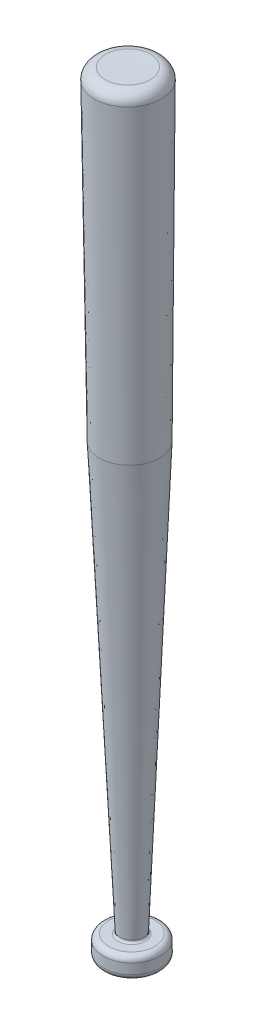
ISO-10303-21;
HEADER;
FILE_DESCRIPTION(('STEP AP214'),'2;1');
FILE_NAME('part.step','',(''),(''),'','','');
FILE_SCHEMA(('AUTOMOTIVE_DESIGN { 1 0 10303 214 1 1 1 1 }'));
ENDSEC;
DATA;
#1=APPLICATION_CONTEXT('core data for automotive mechanical design processes');
#2=APPLICATION_PROTOCOL_DEFINITION('international standard','automotive_design',2000,#1);
#3=PRODUCT_CONTEXT('',#1,'mechanical');
#4=PRODUCT('Part','Part','',(#3));
#5=PRODUCT_RELATED_PRODUCT_CATEGORY('part','',(#4));
#6=PRODUCT_DEFINITION_FORMATION('','',#4);
#7=PRODUCT_DEFINITION_CONTEXT('part definition',#1,'design');
#8=PRODUCT_DEFINITION('design','',#6,#7);
#9=PRODUCT_DEFINITION_SHAPE('','',#8);
#10=(LENGTH_UNIT() NAMED_UNIT(*) SI_UNIT(.MILLI.,.METRE.));
#11=(NAMED_UNIT(*) PLANE_ANGLE_UNIT() SI_UNIT($,.RADIAN.));
#12=(NAMED_UNIT(*) SI_UNIT($,.STERADIAN.) SOLID_ANGLE_UNIT());
#13=UNCERTAINTY_MEASURE_WITH_UNIT(LENGTH_MEASURE(1.E-05),#10,'distance_accuracy_value','');
#14=(GEOMETRIC_REPRESENTATION_CONTEXT(3) GLOBAL_UNCERTAINTY_ASSIGNED_CONTEXT((#13)) GLOBAL_UNIT_ASSIGNED_CONTEXT((#10,
#11,#12)) REPRESENTATION_CONTEXT('',''));
#15=CARTESIAN_POINT('',(0.,0.,0.));
#16=DIRECTION('',(0.,0.,1.));
#17=DIRECTION('',(1.,0.,0.));
#18=AXIS2_PLACEMENT_3D('',#15,#16,#17);
#19=CARTESIAN_POINT('',(-0.000291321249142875,0.0552362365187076,0.));
#20=DIRECTION('',(-0.00527402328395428,0.999986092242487,0.));
#21=DIRECTION('',(-0.999986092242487,-0.00527402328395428,0.));
#22=AXIS2_PLACEMENT_3D('',#19,#20,#21);
#23=CONICAL_SURFACE('',#22,10.4732636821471,1.56552227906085);
#24=CARTESIAN_POINT('',(0.,0.,0.));
#25=VERTEX_POINT('',#24);
#26=VERTEX_LOOP('',#25);
#27=FACE_BOUND('',#26,.T.);
#28=CARTESIAN_POINT('',(-0.000291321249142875,0.0552362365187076,0.));
#29=DIRECTION('',(-0.00527402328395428,0.999986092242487,0.));
#30=DIRECTION('',(-0.999986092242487,-0.00527402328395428,0.));
#31=AXIS2_PLACEMENT_3D('',#28,#29,#30);
#32=CIRCLE('',#31,10.4732636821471);
#33=CARTESIAN_POINT('',(-10.4734093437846,0.,0.));
#34=VERTEX_POINT('',#33);
#35=EDGE_CURVE('E11',#34,#34,#32,.T.);
#36=ORIENTED_EDGE('',*,*,#35,.F.);
#37=EDGE_LOOP('',(#36));
#38=FACE_BOUND('',#37,.T.);
#39=ADVANCED_FACE('F26',(#27,#38),#23,.T.);
#40=CARTESIAN_POINT('',(-0.0136871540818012,2.5951655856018,0.));
#41=DIRECTION('',(-0.00527402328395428,0.999986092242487,0.));
#42=DIRECTION('',(-0.999986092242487,-0.00527402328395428,0.));
#43=AXIS2_PLACEMENT_3D('',#40,#41,#42);
#44=TOROIDAL_SURFACE('',#43,10.4598676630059,2.54);
#45=ORIENTED_EDGE('',*,*,#35,.T.);
#46=EDGE_LOOP('',(#45));
#47=FACE_BOUND('',#46,.T.);
#48=CARTESIAN_POINT('',(-0.0137578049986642,2.60856141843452,0.));
#49=DIRECTION('',(-0.00527402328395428,0.999986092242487,0.));
#50=DIRECTION('',(-0.999986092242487,-0.00527402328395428,0.));
#51=AXIS2_PLACEMENT_3D('',#48,#49,#50);
#52=CIRCLE('',#51,12.9998323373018);
#53=CARTESIAN_POINT('',(12.9858937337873,2.67712283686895,0.));
#54=VERTEX_POINT('',#53);
#55=EDGE_CURVE('E33',#54,#54,#52,.T.);
#56=ORIENTED_EDGE('',*,*,#55,.F.);
#57=EDGE_LOOP('',(#56));
#58=FACE_BOUND('',#57,.T.);
#59=ADVANCED_FACE('F52',(#47,#58),#44,.T.);
#60=CARTESIAN_POINT('',(-0.0377629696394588,7.1600829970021,0.));
#61=DIRECTION('',(0.00527402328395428,-0.999986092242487,0.));
#62=DIRECTION('',(0.999986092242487,0.00527402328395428,0.));
#63=AXIS2_PLACEMENT_3D('',#60,#61,#62);
#64=CONICAL_SURFACE('',#63,12.9758268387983,0.00527404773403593);
#65=CARTESIAN_POINT('',(-0.0377629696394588,7.1600829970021,0.));
#66=DIRECTION('',(-0.00527402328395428,0.999986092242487,0.));
#67=DIRECTION('',(-0.999986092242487,-0.00527402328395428,0.));
#68=AXIS2_PLACEMENT_3D('',#65,#66,#67);
#69=CIRCLE('',#68,12.9758268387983);
#70=CARTESIAN_POINT('',(12.9378834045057,7.22851780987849,0.));
#71=VERTEX_POINT('',#70);
#72=EDGE_CURVE('E64',#71,#71,#69,.T.);
#73=CARTESIAN_POINT('',(12.9858937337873,2.67712283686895,0.));
#74=CARTESIAN_POINT('',(12.9853936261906,2.72453320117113,0.));
#75=CARTESIAN_POINT('',(12.9848935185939,2.77194356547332,0.));
#76=CARTESIAN_POINT('',(12.9838933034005,2.86676429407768,0.));
#77=CARTESIAN_POINT('',(12.9833931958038,2.91417465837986,0.));
#78=CARTESIAN_POINT('',(12.9823929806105,3.00899538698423,0.));
#79=CARTESIAN_POINT('',(12.9818928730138,3.05640575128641,0.));
#80=CARTESIAN_POINT('',(12.9808926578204,3.15122647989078,0.));
#81=CARTESIAN_POINT('',(12.9803925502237,3.19863684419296,0.));
#82=CARTESIAN_POINT('',(12.9793923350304,3.29345757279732,0.));
#83=CARTESIAN_POINT('',(12.9788922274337,3.34086793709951,0.));
#84=CARTESIAN_POINT('',(12.9778920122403,3.43568866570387,0.));
#85=CARTESIAN_POINT('',(12.9773919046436,3.48309903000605,0.));
#86=CARTESIAN_POINT('',(12.9763916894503,3.57791975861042,0.));
#87=CARTESIAN_POINT('',(12.9758915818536,3.6253301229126,0.));
#88=CARTESIAN_POINT('',(12.9748913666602,3.72015085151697,0.));
#89=CARTESIAN_POINT('',(12.9743912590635,3.76756121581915,0.));
#90=CARTESIAN_POINT('',(12.9733910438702,3.86238194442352,0.));
#91=CARTESIAN_POINT('',(12.9728909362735,3.9097923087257,0.));
#92=CARTESIAN_POINT('',(12.9718907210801,4.00461303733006,0.));
#93=CARTESIAN_POINT('',(12.9713906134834,4.05202340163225,0.));
#94=CARTESIAN_POINT('',(12.9703903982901,4.14684413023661,0.));
#95=CARTESIAN_POINT('',(12.9698902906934,4.19425449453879,0.));
#96=CARTESIAN_POINT('',(12.9688900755,4.28907522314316,0.));
#97=CARTESIAN_POINT('',(12.9683899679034,4.33648558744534,0.));
#98=CARTESIAN_POINT('',(12.96738975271,4.43130631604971,0.));
#99=CARTESIAN_POINT('',(12.9668896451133,4.47871668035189,0.));
#100=CARTESIAN_POINT('',(12.9658894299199,4.57353740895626,0.));
#101=CARTESIAN_POINT('',(12.9653893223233,4.62094777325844,0.));
#102=CARTESIAN_POINT('',(12.9643891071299,4.7157685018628,0.));
#103=CARTESIAN_POINT('',(12.9638889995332,4.76317886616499,0.));
#104=CARTESIAN_POINT('',(12.9628887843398,4.85799959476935,0.));
#105=CARTESIAN_POINT('',(12.9623886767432,4.90540995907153,0.));
#106=CARTESIAN_POINT('',(12.9613884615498,5.0002306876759,0.));
#107=CARTESIAN_POINT('',(12.9608883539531,5.04764105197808,0.));
#108=CARTESIAN_POINT('',(12.9598881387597,5.14246178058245,0.));
#109=CARTESIAN_POINT('',(12.9593880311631,5.18987214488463,0.));
#110=CARTESIAN_POINT('',(12.9583878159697,5.284692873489,0.));
#111=CARTESIAN_POINT('',(12.957887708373,5.33210323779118,0.));
#112=CARTESIAN_POINT('',(12.9568874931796,5.42692396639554,0.));
#113=CARTESIAN_POINT('',(12.956387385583,5.47433433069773,0.));
#114=CARTESIAN_POINT('',(12.9553871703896,5.56915505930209,0.));
#115=CARTESIAN_POINT('',(12.9548870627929,5.61656542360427,0.));
#116=CARTESIAN_POINT('',(12.9538868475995,5.71138615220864,0.));
#117=CARTESIAN_POINT('',(12.9533867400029,5.75879651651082,0.));
#118=CARTESIAN_POINT('',(12.9523865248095,5.85361724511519,0.));
#119=CARTESIAN_POINT('',(12.9518864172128,5.90102760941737,0.));
#120=CARTESIAN_POINT('',(12.9508862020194,5.99584833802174,0.));
#121=CARTESIAN_POINT('',(12.9503860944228,6.04325870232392,0.));
#122=CARTESIAN_POINT('',(12.9493858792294,6.13807943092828,0.));
#123=CARTESIAN_POINT('',(12.9488857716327,6.18548979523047,0.));
#124=CARTESIAN_POINT('',(12.9478855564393,6.28031052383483,0.));
#125=CARTESIAN_POINT('',(12.9473854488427,6.32772088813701,0.));
#126=CARTESIAN_POINT('',(12.9463852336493,6.42254161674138,0.));
#127=CARTESIAN_POINT('',(12.9458851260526,6.46995198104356,0.));
#128=CARTESIAN_POINT('',(12.9448849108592,6.56477270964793,0.));
#129=CARTESIAN_POINT('',(12.9443848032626,6.61218307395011,0.));
#130=CARTESIAN_POINT('',(12.9433845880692,6.70700380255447,0.));
#131=CARTESIAN_POINT('',(12.9428844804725,6.75441416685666,0.));
#132=CARTESIAN_POINT('',(12.9418842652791,6.84923489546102,0.));
#133=CARTESIAN_POINT('',(12.9413841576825,6.89664525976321,0.));
#134=CARTESIAN_POINT('',(12.9403839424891,6.99146598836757,0.));
#135=CARTESIAN_POINT('',(12.9398838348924,7.03887635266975,0.));
#136=CARTESIAN_POINT('',(12.938883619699,7.13369708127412,0.));
#137=CARTESIAN_POINT('',(12.9383835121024,7.1811074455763,0.));
#138=CARTESIAN_POINT('',(12.9378834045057,7.22851780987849,0.));
#139=B_SPLINE_CURVE_WITH_KNOTS('',3,(#73,#74,#75,#76,#77,#78,#79,#80,#81,#82,#83,#84,#85,#86,
#87,#88,#89,#90,#91,#92,#93,#94,#95,#96,#97,#98,#99,#100,#101,#102,#103,#104,#105,#106,#107,
#108,#109,#110,#111,#112,#113,#114,#115,#116,#117,#118,#119,#120,#121,#122,#123,#124,#125,#126,
#127,#128,#129,#130,#131,#132,#133,#134,#135,#136,#137,#138),.UNSPECIFIED.,.F.,.F.,(4,2,2,2,2,2,
2,2,2,2,2,2,2,2,2,2,2,2,2,2,2,2,2,2,2,2,2,2,2,2,2,2,4),(0.,0.142239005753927,0.284478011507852,
0.426717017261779,0.568956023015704,0.711195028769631,0.853434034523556,0.995673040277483,
1.13791204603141,1.28015105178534,1.42239005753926,1.56462906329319,1.70686806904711,
1.84910707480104,1.99134608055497,2.13358508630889,2.27582409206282,2.41806309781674,
2.56030210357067,2.7025411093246,2.84478011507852,2.98701912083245,3.12925812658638,
3.2714971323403,3.41373613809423,3.55597514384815,3.69821414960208,3.84045315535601,
3.98269216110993,4.12493116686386,4.26717017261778,4.40940917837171,4.55164818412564),.UNSPECIFIED.);
#140=EDGE_CURVE('BSEAM56',#54,#71,#139,.T.);
#141=ORIENTED_EDGE('',*,*,#55,.T.);
#142=ORIENTED_EDGE('',*,*,#72,.F.);
#143=ORIENTED_EDGE('',*,*,#140,.T.);
#144=ORIENTED_EDGE('',*,*,#140,.F.);
#145=EDGE_LOOP('',(#141,#143,#142,#144));
#146=FACE_BOUND('',#145,.T.);
#147=ADVANCED_FACE('F56',(#146),#64,.T.);
#148=CARTESIAN_POINT('',(-0.0376923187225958,7.14668716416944,0.));
#149=DIRECTION('',(-0.00527402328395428,0.999986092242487,0.));
#150=DIRECTION('',(-0.999986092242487,-0.00527402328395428,0.));
#151=AXIS2_PLACEMENT_3D('',#148,#149,#150);
#152=TOROIDAL_SURFACE('',#151,10.4358621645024,2.54);
#153=ORIENTED_EDGE('',*,*,#72,.T.);
#154=EDGE_LOOP('',(#153));
#155=FACE_BOUND('',#154,.T.);
#156=CARTESIAN_POINT('',(-0.0510881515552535,9.68661651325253,0.));
#157=DIRECTION('',(-0.00527402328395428,0.999986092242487,0.));
#158=DIRECTION('',(-0.999986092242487,-0.00527402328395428,0.));
#159=AXIS2_PLACEMENT_3D('',#156,#157,#158);
#160=CIRCLE('',#159,10.4224661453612);
#161=CARTESIAN_POINT('',(-10.4734093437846,9.63164818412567,0.));
#162=VERTEX_POINT('',#161);
#163=EDGE_CURVE('E66',#162,#162,#160,.T.);
#164=ORIENTED_EDGE('',*,*,#163,.F.);
#165=EDGE_LOOP('',(#164));
#166=FACE_BOUND('',#165,.T.);
#167=ADVANCED_FACE('F105',(#155,#166),#152,.T.);
#168=CARTESIAN_POINT('',(-0.0509715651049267,9.66451103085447,0.));
#169=DIRECTION('',(-0.00527402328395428,0.999986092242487,0.));
#170=DIRECTION('',(-0.999986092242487,-0.00527402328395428,0.));
#171=AXIS2_PLACEMENT_3D('',#168,#169,#170);
#172=CONICAL_SURFACE('',#171,6.23107729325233,1.56552227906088);
#173=CARTESIAN_POINT('',(-0.0509715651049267,9.66451103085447,0.));
#174=DIRECTION('',(-0.00527402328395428,0.999986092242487,0.));
#175=DIRECTION('',(-0.999986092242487,-0.00527402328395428,0.));
#176=AXIS2_PLACEMENT_3D('',#173,#174,#175);
#177=CIRCLE('',#176,6.23107729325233);
#178=CARTESIAN_POINT('',(-6.28196219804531,9.63164818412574,0.));
#179=VERTEX_POINT('',#178);
#180=EDGE_CURVE('E71',#179,#179,#177,.T.);
#181=CARTESIAN_POINT('',(-10.4734093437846,9.63164818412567,0.));
#182=CARTESIAN_POINT('',(-10.4297484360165,9.63164818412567,0.));
#183=CARTESIAN_POINT('',(-10.3860875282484,9.63164818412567,0.));
#184=CARTESIAN_POINT('',(-10.2987657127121,9.63164818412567,0.));
#185=CARTESIAN_POINT('',(-10.255104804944,9.63164818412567,0.));
#186=CARTESIAN_POINT('',(-10.1677829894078,9.63164818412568,0.));
#187=CARTESIAN_POINT('',(-10.1241220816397,9.63164818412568,0.));
#188=CARTESIAN_POINT('',(-10.0368002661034,9.63164818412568,0.));
#189=CARTESIAN_POINT('',(-9.99313935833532,9.63164818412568,0.));
#190=CARTESIAN_POINT('',(-9.90581754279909,9.63164818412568,0.));
#191=CARTESIAN_POINT('',(-9.86215663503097,9.63164818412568,0.));
#192=CARTESIAN_POINT('',(-9.77483481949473,9.63164818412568,0.));
#193=CARTESIAN_POINT('',(-9.73117391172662,9.63164818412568,0.));
#194=CARTESIAN_POINT('',(-9.64385209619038,9.63164818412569,0.));
#195=CARTESIAN_POINT('',(-9.60019118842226,9.63164818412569,0.));
#196=CARTESIAN_POINT('',(-9.51286937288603,9.63164818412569,0.));
#197=CARTESIAN_POINT('',(-9.46920846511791,9.63164818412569,0.));
#198=CARTESIAN_POINT('',(-9.38188664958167,9.63164818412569,0.));
#199=CARTESIAN_POINT('',(-9.33822574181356,9.63164818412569,0.));
#200=CARTESIAN_POINT('',(-9.25090392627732,9.63164818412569,0.));
#201=CARTESIAN_POINT('',(-9.2072430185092,9.63164818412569,0.));
#202=CARTESIAN_POINT('',(-9.11992120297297,9.63164818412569,0.));
#203=CARTESIAN_POINT('',(-9.07626029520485,9.63164818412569,0.));
#204=CARTESIAN_POINT('',(-8.98893847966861,9.6316481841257,0.));
#205=CARTESIAN_POINT('',(-8.9452775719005,9.6316481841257,0.));
#206=CARTESIAN_POINT('',(-8.85795575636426,9.6316481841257,0.));
#207=CARTESIAN_POINT('',(-8.81429484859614,9.6316481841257,0.));
#208=CARTESIAN_POINT('',(-8.72697303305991,9.6316481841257,0.));
#209=CARTESIAN_POINT('',(-8.68331212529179,9.6316481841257,0.));
#210=CARTESIAN_POINT('',(-8.59599030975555,9.6316481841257,0.));
#211=CARTESIAN_POINT('',(-8.55232940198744,9.6316481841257,0.));
#212=CARTESIAN_POINT('',(-8.4650075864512,9.63164818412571,0.));
#213=CARTESIAN_POINT('',(-8.42134667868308,9.63164818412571,0.));
#214=CARTESIAN_POINT('',(-8.33402486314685,9.63164818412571,0.));
#215=CARTESIAN_POINT('',(-8.29036395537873,9.63164818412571,0.));
#216=CARTESIAN_POINT('',(-8.20304213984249,9.63164818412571,0.));
#217=CARTESIAN_POINT('',(-8.15938123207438,9.63164818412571,0.));
#218=CARTESIAN_POINT('',(-8.07205941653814,9.63164818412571,0.));
#219=CARTESIAN_POINT('',(-8.02839850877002,9.63164818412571,0.));
#220=CARTESIAN_POINT('',(-7.94107669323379,9.63164818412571,0.));
#221=CARTESIAN_POINT('',(-7.89741578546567,9.63164818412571,0.));
#222=CARTESIAN_POINT('',(-7.81009396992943,9.63164818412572,0.));
#223=CARTESIAN_POINT('',(-7.76643306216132,9.63164818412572,0.));
#224=CARTESIAN_POINT('',(-7.67911124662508,9.63164818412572,0.));
#225=CARTESIAN_POINT('',(-7.63545033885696,9.63164818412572,0.));
#226=CARTESIAN_POINT('',(-7.54812852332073,9.63164818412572,0.));
#227=CARTESIAN_POINT('',(-7.50446761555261,9.63164818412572,0.));
#228=CARTESIAN_POINT('',(-7.41714580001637,9.63164818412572,0.));
#229=CARTESIAN_POINT('',(-7.37348489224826,9.63164818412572,0.));
#230=CARTESIAN_POINT('',(-7.28616307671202,9.63164818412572,0.));
#231=CARTESIAN_POINT('',(-7.2425021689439,9.63164818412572,0.));
#232=CARTESIAN_POINT('',(-7.15518035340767,9.63164818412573,0.));
#233=CARTESIAN_POINT('',(-7.11151944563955,9.63164818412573,0.));
#234=CARTESIAN_POINT('',(-7.02419763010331,9.63164818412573,0.));
#235=CARTESIAN_POINT('',(-6.9805367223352,9.63164818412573,0.));
#236=CARTESIAN_POINT('',(-6.89321490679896,9.63164818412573,0.));
#237=CARTESIAN_POINT('',(-6.84955399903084,9.63164818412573,0.));
#238=CARTESIAN_POINT('',(-6.76223218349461,9.63164818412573,0.));
#239=CARTESIAN_POINT('',(-6.71857127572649,9.63164818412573,0.));
#240=CARTESIAN_POINT('',(-6.63124946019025,9.63164818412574,0.));
#241=CARTESIAN_POINT('',(-6.58758855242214,9.63164818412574,0.));
#242=CARTESIAN_POINT('',(-6.5002667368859,9.63164818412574,0.));
#243=CARTESIAN_POINT('',(-6.45660582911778,9.63164818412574,0.));
#244=CARTESIAN_POINT('',(-6.36928401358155,9.63164818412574,0.));
#245=CARTESIAN_POINT('',(-6.32562310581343,9.63164818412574,0.));
#246=CARTESIAN_POINT('',(-6.28196219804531,9.63164818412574,0.));
#247=B_SPLINE_CURVE_WITH_KNOTS('',3,(#181,#182,#183,#184,#185,#186,#187,#188,#189,#190,#191,
#192,#193,#194,#195,#196,#197,#198,#199,#200,#201,#202,#203,#204,#205,#206,#207,#208,#209,#210,
#211,#212,#213,#214,#215,#216,#217,#218,#219,#220,#221,#222,#223,#224,#225,#226,#227,#228,#229,
#230,#231,#232,#233,#234,#235,#236,#237,#238,#239,#240,#241,#242,#243,#244,#245,#246),
.UNSPECIFIED.,.F.,.F.,(4,2,2,2,2,2,2,2,2,2,2,2,2,2,2,2,2,2,2,2,2,2,2,2,2,2,2,2,2,2,2,2,4),(0.,
0.130982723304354,0.261965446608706,0.39294816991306,0.523930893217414,0.654913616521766,
0.785896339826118,0.916879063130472,1.04786178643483,1.17884450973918,1.30982723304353,
1.44080995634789,1.57179267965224,1.70277540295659,1.83375812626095,1.9647408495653,
2.09572357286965,2.22670629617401,2.35768901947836,2.48867174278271,2.61965446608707,
2.75063718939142,2.88161991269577,3.01260263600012,3.14358535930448,3.27456808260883,
3.40555080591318,3.53653352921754,3.66751625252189,3.79849897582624,3.9294816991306,
4.06046442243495,4.1914471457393),.UNSPECIFIED.);
#248=EDGE_CURVE('BSEAM101',#162,#179,#247,.T.);
#249=ORIENTED_EDGE('',*,*,#163,.T.);
#250=ORIENTED_EDGE('',*,*,#180,.F.);
#251=ORIENTED_EDGE('',*,*,#248,.T.);
#252=ORIENTED_EDGE('',*,*,#248,.F.);
#253=EDGE_LOOP('',(#249,#251,#250,#252));
#254=FACE_BOUND('',#253,.T.);
#255=ADVANCED_FACE('F101',(#254),#172,.F.);
#256=CARTESIAN_POINT('',(-0.0556664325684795,10.5546857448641,0.));
#257=DIRECTION('',(-0.00527402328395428,0.999986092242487,0.));
#258=DIRECTION('',(-0.999986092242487,-0.00527402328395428,0.));
#259=AXIS2_PLACEMENT_3D('',#256,#257,#258);
#260=TOROIDAL_SURFACE('',#259,6.22638236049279,0.890199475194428);
#261=ORIENTED_EDGE('',*,*,#180,.T.);
#262=EDGE_LOOP('',(#261));
#263=FACE_BOUND('',#262,.T.);
#264=CARTESIAN_POINT('',(-0.0569990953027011,10.8073665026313,0.));
#265=DIRECTION('',(-0.00527402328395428,0.999986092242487,0.));
#266=DIRECTION('',(-0.999986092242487,-0.00527402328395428,0.));
#267=AXIS2_PLACEMENT_3D('',#264,#265,#266);
#268=CIRCLE('',#267,5.37279829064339);
#269=CARTESIAN_POINT('',(-5.4297226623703,10.7790302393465,0.));
#270=VERTEX_POINT('',#269);
#271=EDGE_CURVE('E74',#270,#270,#268,.T.);
#272=ORIENTED_EDGE('',*,*,#271,.F.);
#273=EDGE_LOOP('',(#272));
#274=FACE_BOUND('',#273,.T.);
#275=ADVANCED_FACE('F95',(#263,#274),#260,.F.);
#276=CARTESIAN_POINT('',(-1.07220957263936,203.29729371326,0.));
#277=DIRECTION('',(-0.00527402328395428,0.999986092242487,0.));
#278=DIRECTION('',(-0.999986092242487,-0.00527402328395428,0.));
#279=AXIS2_PLACEMENT_3D('',#276,#277,#278);
#280=CONICAL_SURFACE('',#279,13.6837631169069,0.0431487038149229);
#281=CARTESIAN_POINT('',(-1.07220957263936,203.29729371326,0.));
#282=DIRECTION('',(-0.00527402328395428,0.999986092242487,0.));
#283=DIRECTION('',(-0.999986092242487,-0.00527402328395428,0.));
#284=AXIS2_PLACEMENT_3D('',#281,#282,#283);
#285=CIRCLE('',#284,13.6837631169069);
#286=CARTESIAN_POINT('',(-14.7557823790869,203.225125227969,0.));
#287=VERTEX_POINT('',#286);
#288=EDGE_CURVE('E77',#287,#287,#285,.T.);
#289=CARTESIAN_POINT('',(-5.4297226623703,10.7790302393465,0.));
#290=CARTESIAN_POINT('',(-5.52686911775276,12.7836770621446,0.));
#291=CARTESIAN_POINT('',(-5.62401557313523,14.7883238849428,0.));
#292=CARTESIAN_POINT('',(-5.81830848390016,18.7976175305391,0.));
#293=CARTESIAN_POINT('',(-5.91545493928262,20.8022643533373,0.));
#294=CARTESIAN_POINT('',(-6.10974785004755,24.8115579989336,0.));
#295=CARTESIAN_POINT('',(-6.20689430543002,26.8162048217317,0.));
#296=CARTESIAN_POINT('',(-6.40118721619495,30.825498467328,0.));
#297=CARTESIAN_POINT('',(-6.49833367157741,32.8301452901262,0.));
#298=CARTESIAN_POINT('',(-6.69262658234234,36.8394389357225,0.));
#299=CARTESIAN_POINT('',(-6.78977303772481,38.8440857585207,0.));
#300=CARTESIAN_POINT('',(-6.98406594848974,42.853379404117,0.));
#301=CARTESIAN_POINT('',(-7.0812124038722,44.8580262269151,0.));
#302=CARTESIAN_POINT('',(-7.27550531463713,48.8673198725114,0.));
#303=CARTESIAN_POINT('',(-7.3726517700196,50.8719666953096,0.));
#304=CARTESIAN_POINT('',(-7.56694468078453,54.8812603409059,0.));
#305=CARTESIAN_POINT('',(-7.66409113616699,56.885907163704,0.));
#306=CARTESIAN_POINT('',(-7.85838404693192,60.8952008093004,0.));
#307=CARTESIAN_POINT('',(-7.95553050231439,62.8998476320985,0.));
#308=CARTESIAN_POINT('',(-8.14982341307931,66.9091412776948,0.));
#309=CARTESIAN_POINT('',(-8.24696986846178,68.913788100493,0.));
#310=CARTESIAN_POINT('',(-8.44126277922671,72.9230817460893,0.));
#311=CARTESIAN_POINT('',(-8.53840923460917,74.9277285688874,0.));
#312=CARTESIAN_POINT('',(-8.7327021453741,78.9370222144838,0.));
#313=CARTESIAN_POINT('',(-8.82984860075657,80.9416690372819,0.));
#314=CARTESIAN_POINT('',(-9.0241415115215,84.9509626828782,0.));
#315=CARTESIAN_POINT('',(-9.12128796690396,86.9556095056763,0.));
#316=CARTESIAN_POINT('',(-9.31558087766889,90.9649031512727,0.));
#317=CARTESIAN_POINT('',(-9.41272733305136,92.9695499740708,0.));
#318=CARTESIAN_POINT('',(-9.60702024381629,96.9788436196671,0.));
#319=CARTESIAN_POINT('',(-9.70416669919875,98.9834904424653,0.));
#320=CARTESIAN_POINT('',(-9.89845960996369,102.992784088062,0.));
#321=CARTESIAN_POINT('',(-9.99560606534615,104.99743091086,0.));
#322=CARTESIAN_POINT('',(-10.1898989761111,109.006724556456,0.));
#323=CARTESIAN_POINT('',(-10.2870454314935,111.011371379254,0.));
#324=CARTESIAN_POINT('',(-10.4813383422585,115.020665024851,0.));
#325=CARTESIAN_POINT('',(-10.5784847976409,117.025311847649,0.));
#326=CARTESIAN_POINT('',(-10.7727777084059,121.034605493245,0.));
#327=CARTESIAN_POINT('',(-10.8699241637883,123.039252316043,0.));
#328=CARTESIAN_POINT('',(-11.0642170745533,127.048545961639,0.));
#329=CARTESIAN_POINT('',(-11.1613635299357,129.053192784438,0.));
#330=CARTESIAN_POINT('',(-11.3556564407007,133.062486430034,0.));
#331=CARTESIAN_POINT('',(-11.4528028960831,135.067133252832,0.));
#332=CARTESIAN_POINT('',(-11.6470958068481,139.076426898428,0.));
#333=CARTESIAN_POINT('',(-11.7442422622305,141.081073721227,0.));
#334=CARTESIAN_POINT('',(-11.9385351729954,145.090367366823,0.));
#335=CARTESIAN_POINT('',(-12.0356816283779,147.095014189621,0.));
#336=CARTESIAN_POINT('',(-12.2299745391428,151.104307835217,0.));
#337=CARTESIAN_POINT('',(-12.3271209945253,153.108954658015,0.));
#338=CARTESIAN_POINT('',(-12.5214139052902,157.118248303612,0.));
#339=CARTESIAN_POINT('',(-12.6185603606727,159.12289512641,0.));
#340=CARTESIAN_POINT('',(-12.8128532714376,163.132188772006,0.));
#341=CARTESIAN_POINT('',(-12.9099997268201,165.136835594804,0.));
#342=CARTESIAN_POINT('',(-13.104292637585,169.146129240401,0.));
#343=CARTESIAN_POINT('',(-13.2014390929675,171.150776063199,0.));
#344=CARTESIAN_POINT('',(-13.3957320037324,175.160069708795,0.));
#345=CARTESIAN_POINT('',(-13.4928784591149,177.164716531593,0.));
#346=CARTESIAN_POINT('',(-13.6871713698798,181.17401017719,0.));
#347=CARTESIAN_POINT('',(-13.7843178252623,183.178656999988,0.));
#348=CARTESIAN_POINT('',(-13.9786107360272,187.187950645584,0.));
#349=CARTESIAN_POINT('',(-14.0757571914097,189.192597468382,0.));
#350=CARTESIAN_POINT('',(-14.2700501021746,193.201891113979,0.));
#351=CARTESIAN_POINT('',(-14.3671965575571,195.206537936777,0.));
#352=CARTESIAN_POINT('',(-14.561489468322,199.215831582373,0.));
#353=CARTESIAN_POINT('',(-14.6586359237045,201.220478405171,0.));
#354=CARTESIAN_POINT('',(-14.7557823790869,203.225125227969,0.));
#355=B_SPLINE_CURVE_WITH_KNOTS('',3,(#289,#290,#291,#292,#293,#294,#295,#296,#297,#298,#299,
#300,#301,#302,#303,#304,#305,#306,#307,#308,#309,#310,#311,#312,#313,#314,#315,#316,#317,#318,
#319,#320,#321,#322,#323,#324,#325,#326,#327,#328,#329,#330,#331,#332,#333,#334,#335,#336,#337,
#338,#339,#340,#341,#342,#343,#344,#345,#346,#347,#348,#349,#350,#351,#352,#353,#354),
.UNSPECIFIED.,.F.,.F.,(4,2,2,2,2,2,2,2,2,2,2,2,2,2,2,2,2,2,2,2,2,2,2,2,2,2,2,2,2,2,2,2,4),(0.,
6.0209979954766,12.0419959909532,18.0629939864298,24.0839919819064,30.1049899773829,
36.1259879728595,42.1469859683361,48.1679839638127,54.1889819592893,60.2099799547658,
66.2309779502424,72.251975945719,78.2729739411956,84.2939719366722,90.3149699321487,
96.3359679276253,102.356965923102,108.377963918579,114.398961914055,120.419959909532,
126.440957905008,132.461955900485,138.482953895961,144.503951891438,150.524949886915,
156.545947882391,162.566945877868,168.587943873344,174.608941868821,180.629939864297,
186.650937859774,192.671935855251),.UNSPECIFIED.);
#356=EDGE_CURVE('BSEAM89',#270,#287,#355,.T.);
#357=ORIENTED_EDGE('',*,*,#271,.T.);
#358=ORIENTED_EDGE('',*,*,#288,.F.);
#359=ORIENTED_EDGE('',*,*,#356,.T.);
#360=ORIENTED_EDGE('',*,*,#356,.F.);
#361=EDGE_LOOP('',(#357,#359,#358,#360));
#362=FACE_BOUND('',#361,.T.);
#363=ADVANCED_FACE('F89',(#362),#280,.T.);
#364=CARTESIAN_POINT('',(-1.82039002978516,345.156745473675,0.));
#365=DIRECTION('',(-0.00527402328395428,0.999986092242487,0.));
#366=DIRECTION('',(-0.999986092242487,-0.00527402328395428,0.));
#367=AXIS2_PLACEMENT_3D('',#364,#365,#366);
#368=CONICAL_SURFACE('',#367,15.2225708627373,0.0108468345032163);
#369=CARTESIAN_POINT('',(-1.82039002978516,345.156745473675,0.));
#370=DIRECTION('',(-0.00527402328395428,0.999986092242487,0.));
#371=DIRECTION('',(-0.999986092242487,-0.00527402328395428,0.));
#372=AXIS2_PLACEMENT_3D('',#369,#370,#371);
#373=CIRCLE('',#372,15.2225708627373);
#374=CARTESIAN_POINT('',(-17.0427491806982,345.076461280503,0.));
#375=VERTEX_POINT('',#374);
#376=EDGE_CURVE('E80',#375,#375,#373,.T.);
#377=CARTESIAN_POINT('',(-14.7557823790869,203.225125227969,0.));
#378=CARTESIAN_POINT('',(-14.7796049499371,204.70274331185,0.));
#379=CARTESIAN_POINT('',(-14.8034275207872,206.18036139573,0.));
#380=CARTESIAN_POINT('',(-14.8510726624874,209.135597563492,0.));
#381=CARTESIAN_POINT('',(-14.8748952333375,210.613215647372,0.));
#382=CARTESIAN_POINT('',(-14.9225403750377,213.568451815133,0.));
#383=CARTESIAN_POINT('',(-14.9463629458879,215.046069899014,0.));
#384=CARTESIAN_POINT('',(-14.9940080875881,218.001306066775,0.));
#385=CARTESIAN_POINT('',(-15.0178306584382,219.478924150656,0.));
#386=CARTESIAN_POINT('',(-15.0654758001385,222.434160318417,0.));
#387=CARTESIAN_POINT('',(-15.0892983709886,223.911778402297,0.));
#388=CARTESIAN_POINT('',(-15.1369435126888,226.867014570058,0.));
#389=CARTESIAN_POINT('',(-15.1607660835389,228.344632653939,0.));
#390=CARTESIAN_POINT('',(-15.2084112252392,231.2998688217,0.));
#391=CARTESIAN_POINT('',(-15.2322337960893,232.777486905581,0.));
#392=CARTESIAN_POINT('',(-15.2798789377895,235.732723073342,0.));
#393=CARTESIAN_POINT('',(-15.3037015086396,237.210341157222,0.));
#394=CARTESIAN_POINT('',(-15.3513466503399,240.165577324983,0.));
#395=CARTESIAN_POINT('',(-15.37516922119,241.643195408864,0.));
#396=CARTESIAN_POINT('',(-15.4228143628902,244.598431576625,0.));
#397=CARTESIAN_POINT('',(-15.4466369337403,246.076049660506,0.));
#398=CARTESIAN_POINT('',(-15.4942820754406,249.031285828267,0.));
#399=CARTESIAN_POINT('',(-15.5181046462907,250.508903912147,0.));
#400=CARTESIAN_POINT('',(-15.5657497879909,253.464140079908,0.));
#401=CARTESIAN_POINT('',(-15.589572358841,254.941758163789,0.));
#402=CARTESIAN_POINT('',(-15.6372175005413,257.89699433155,0.));
#403=CARTESIAN_POINT('',(-15.6610400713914,259.374612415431,0.));
#404=CARTESIAN_POINT('',(-15.7086852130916,262.329848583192,0.));
#405=CARTESIAN_POINT('',(-15.7325077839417,263.807466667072,0.));
#406=CARTESIAN_POINT('',(-15.780152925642,266.762702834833,0.));
#407=CARTESIAN_POINT('',(-15.8039754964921,268.240320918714,0.));
#408=CARTESIAN_POINT('',(-15.8516206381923,271.195557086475,0.));
#409=CARTESIAN_POINT('',(-15.8754432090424,272.673175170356,0.));
#410=CARTESIAN_POINT('',(-15.9230883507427,275.628411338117,0.));
#411=CARTESIAN_POINT('',(-15.9469109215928,277.106029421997,0.));
#412=CARTESIAN_POINT('',(-15.994556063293,280.061265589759,0.));
#413=CARTESIAN_POINT('',(-16.0183786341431,281.538883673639,0.));
#414=CARTESIAN_POINT('',(-16.0660237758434,284.4941198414,0.));
#415=CARTESIAN_POINT('',(-16.0898463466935,285.971737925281,0.));
#416=CARTESIAN_POINT('',(-16.1374914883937,288.926974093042,0.));
#417=CARTESIAN_POINT('',(-16.1613140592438,290.404592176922,0.));
#418=CARTESIAN_POINT('',(-16.2089592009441,293.359828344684,0.));
#419=CARTESIAN_POINT('',(-16.2327817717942,294.837446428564,0.));
#420=CARTESIAN_POINT('',(-16.2804269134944,297.792682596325,0.));
#421=CARTESIAN_POINT('',(-16.3042494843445,299.270300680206,0.));
#422=CARTESIAN_POINT('',(-16.3518946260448,302.225536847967,0.));
#423=CARTESIAN_POINT('',(-16.3757171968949,303.703154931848,0.));
#424=CARTESIAN_POINT('',(-16.4233623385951,306.658391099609,0.));
#425=CARTESIAN_POINT('',(-16.4471849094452,308.136009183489,0.));
#426=CARTESIAN_POINT('',(-16.4948300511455,311.09124535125,0.));
#427=CARTESIAN_POINT('',(-16.5186526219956,312.568863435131,0.));
#428=CARTESIAN_POINT('',(-16.5662977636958,315.524099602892,0.));
#429=CARTESIAN_POINT('',(-16.590120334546,317.001717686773,0.));
#430=CARTESIAN_POINT('',(-16.6377654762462,319.956953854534,0.));
#431=CARTESIAN_POINT('',(-16.6615880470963,321.434571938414,0.));
#432=CARTESIAN_POINT('',(-16.7092331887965,324.389808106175,0.));
#433=CARTESIAN_POINT('',(-16.7330557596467,325.867426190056,0.));
#434=CARTESIAN_POINT('',(-16.7807009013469,328.822662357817,0.));
#435=CARTESIAN_POINT('',(-16.804523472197,330.300280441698,0.));
#436=CARTESIAN_POINT('',(-16.8521686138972,333.255516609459,0.));
#437=CARTESIAN_POINT('',(-16.8759911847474,334.733134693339,0.));
#438=CARTESIAN_POINT('',(-16.9236363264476,337.6883708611,0.));
#439=CARTESIAN_POINT('',(-16.9474588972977,339.165988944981,0.));
#440=CARTESIAN_POINT('',(-16.9951040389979,342.121225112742,0.));
#441=CARTESIAN_POINT('',(-17.0189266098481,343.598843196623,0.));
#442=CARTESIAN_POINT('',(-17.0427491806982,345.076461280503,0.));
#443=B_SPLINE_CURVE_WITH_KNOTS('',3,(#377,#378,#379,#380,#381,#382,#383,#384,#385,#386,#387,
#388,#389,#390,#391,#392,#393,#394,#395,#396,#397,#398,#399,#400,#401,#402,#403,#404,#405,#406,
#407,#408,#409,#410,#411,#412,#413,#414,#415,#416,#417,#418,#419,#420,#421,#422,#423,#424,#425,
#426,#427,#428,#429,#430,#431,#432,#433,#434,#435,#436,#437,#438,#439,#440,#441,#442),
.UNSPECIFIED.,.F.,.F.,(4,2,2,2,2,2,2,2,2,2,2,2,2,2,2,2,2,2,2,2,2,2,2,2,2,2,2,2,2,2,2,2,4),(0.,
4.43343032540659,8.86686065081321,13.3002909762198,17.7337213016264,22.167151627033,
26.6005819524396,31.0340122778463,35.4674426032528,39.9008729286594,44.3343032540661,
48.7677335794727,53.2011639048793,57.6345942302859,62.0680245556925,66.5014548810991,
70.9348852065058,75.3683155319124,79.8017458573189,84.2351761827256,88.6686065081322,
93.1020368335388,97.5354671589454,101.968897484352,106.402327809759,110.835758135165,
115.269188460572,119.702618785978,124.136049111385,128.569479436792,133.002909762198,
137.436340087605,141.869770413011),.UNSPECIFIED.);
#444=EDGE_CURVE('BSEAM47',#287,#375,#443,.T.);
#445=ORIENTED_EDGE('',*,*,#288,.T.);
#446=ORIENTED_EDGE('',*,*,#376,.F.);
#447=ORIENTED_EDGE('',*,*,#444,.T.);
#448=ORIENTED_EDGE('',*,*,#444,.F.);
#449=EDGE_LOOP('',(#445,#447,#446,#448));
#450=FACE_BOUND('',#449,.T.);
#451=ADVANCED_FACE('F47',(#450),#368,.T.);
#452=CARTESIAN_POINT('',(-1.82067816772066,345.211378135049,0.));
#453=DIRECTION('',(-0.00527402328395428,0.999986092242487,0.));
#454=DIRECTION('',(-0.999986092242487,-0.00527402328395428,0.));
#455=AXIS2_PLACEMENT_3D('',#452,#453,#454);
#456=TOROIDAL_SURFACE('',#455,10.1859605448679,5.03690662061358);
#457=ORIENTED_EDGE('',*,*,#376,.T.);
#458=EDGE_LOOP('',(#457));
#459=FACE_BOUND('',#458,.T.);
#460=CARTESIAN_POINT('',(-1.8472425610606,350.248144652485,0.));
#461=DIRECTION('',(-0.00527402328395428,0.999986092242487,0.));
#462=DIRECTION('',(-0.999986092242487,-0.00527402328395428,0.));
#463=AXIS2_PLACEMENT_3D('',#460,#461,#462);
#464=CIRCLE('',#463,10.1593957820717);
#465=CARTESIAN_POINT('',(-12.0064970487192,350.194563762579,0.));
#466=VERTEX_POINT('',#465);
#467=EDGE_CURVE('E83',#466,#466,#464,.T.);
#468=ORIENTED_EDGE('',*,*,#467,.F.);
#469=EDGE_LOOP('',(#468));
#470=FACE_BOUND('',#469,.T.);
#471=ADVANCED_FACE('F41',(#459,#470),#456,.T.);
#472=CARTESIAN_POINT('',(-1.84695997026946,350.194563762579,0.));
#473=DIRECTION('',(-0.00527402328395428,0.999986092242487,0.));
#474=DIRECTION('',(-0.999986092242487,-0.00527402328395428,0.));
#475=AXIS2_PLACEMENT_3D('',#472,#473,#474);
#476=CONICAL_SURFACE('',#475,0.,1.56552227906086);
#477=ORIENTED_EDGE('',*,*,#467,.T.);
#478=EDGE_LOOP('',(#477));
#479=FACE_BOUND('',#478,.T.);
#480=CARTESIAN_POINT('',(-1.84695997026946,350.194563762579,0.));
#481=VERTEX_POINT('',#480);
#482=VERTEX_LOOP('',#481);
#483=FACE_BOUND('',#482,.T.);
#484=ADVANCED_FACE('F39',(#479,#483),#476,.F.);
#485=CLOSED_SHELL('',(#39,#59,#147,#167,#255,#275,#363,#451,#471,#484));
#486=MANIFOLD_SOLID_BREP('B2',#485);
#487=ADVANCED_BREP_SHAPE_REPRESENTATION('',(#18,#486),#14);
#488=SHAPE_DEFINITION_REPRESENTATION(#9,#487);
ENDSEC;
END-ISO-10303-21;
